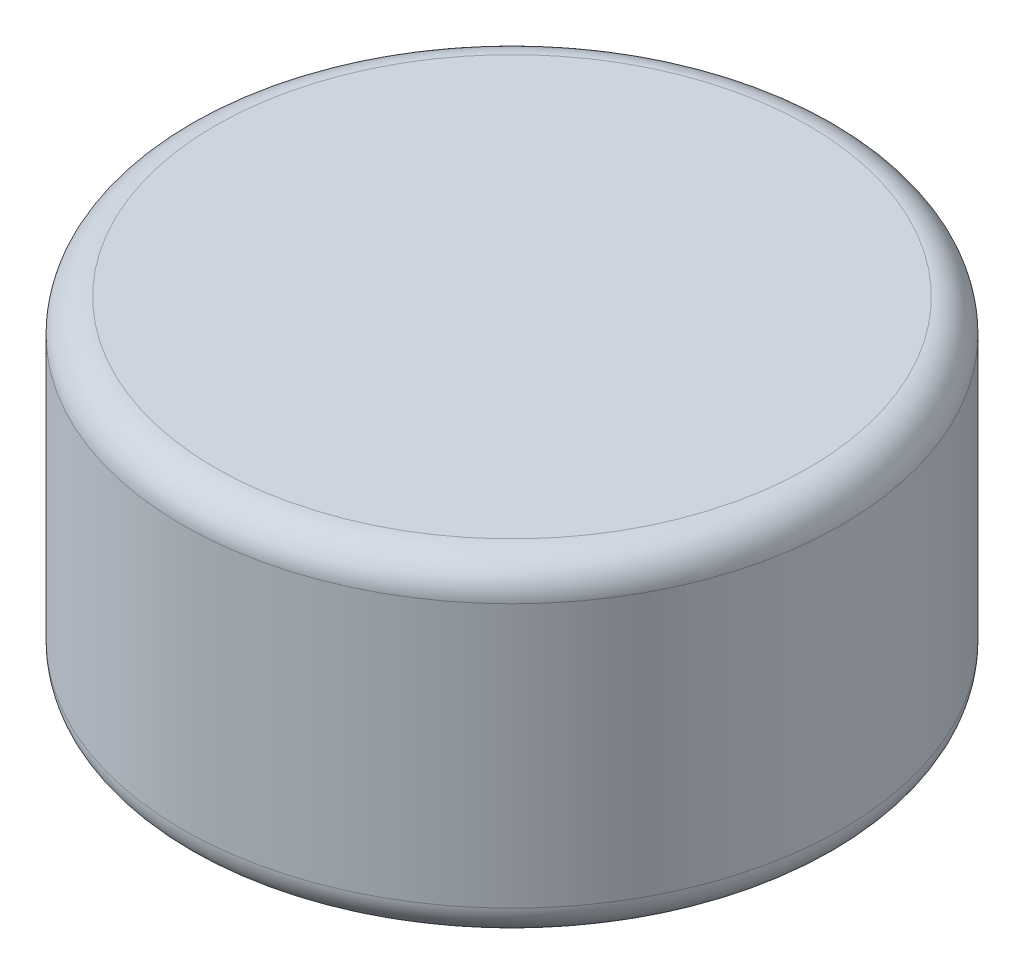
ISO-10303-21;
HEADER;
FILE_DESCRIPTION(('STEP AP214'),'2;1');
FILE_NAME('part.step','',(''),(''),'','','');
FILE_SCHEMA(('AUTOMOTIVE_DESIGN { 1 0 10303 214 1 1 1 1 }'));
ENDSEC;
DATA;
#1=APPLICATION_CONTEXT('core data for automotive mechanical design processes');
#2=APPLICATION_PROTOCOL_DEFINITION('international standard','automotive_design',2000,#1);
#3=PRODUCT_CONTEXT('',#1,'mechanical');
#4=PRODUCT('Part','Part','',(#3));
#5=PRODUCT_RELATED_PRODUCT_CATEGORY('part','',(#4));
#6=PRODUCT_DEFINITION_FORMATION('','',#4);
#7=PRODUCT_DEFINITION_CONTEXT('part definition',#1,'design');
#8=PRODUCT_DEFINITION('design','',#6,#7);
#9=PRODUCT_DEFINITION_SHAPE('','',#8);
#10=(LENGTH_UNIT() NAMED_UNIT(*) SI_UNIT(.MILLI.,.METRE.));
#11=(NAMED_UNIT(*) PLANE_ANGLE_UNIT() SI_UNIT($,.RADIAN.));
#12=(NAMED_UNIT(*) SI_UNIT($,.STERADIAN.) SOLID_ANGLE_UNIT());
#13=UNCERTAINTY_MEASURE_WITH_UNIT(LENGTH_MEASURE(1.E-05),#10,'distance_accuracy_value','');
#14=(GEOMETRIC_REPRESENTATION_CONTEXT(3) GLOBAL_UNCERTAINTY_ASSIGNED_CONTEXT((#13)) GLOBAL_UNIT_ASSIGNED_CONTEXT((#10,
#11,#12)) REPRESENTATION_CONTEXT('',''));
#15=CARTESIAN_POINT('',(0.,0.,0.));
#16=DIRECTION('',(0.,0.,1.));
#17=DIRECTION('',(1.,0.,0.));
#18=AXIS2_PLACEMENT_3D('',#15,#16,#17);
#19=CARTESIAN_POINT('',(0.,0.79375,0.));
#20=DIRECTION('',(0.,-1.,0.));
#21=DIRECTION('',(0.,0.,-1.));
#22=AXIS2_PLACEMENT_3D('',#19,#20,#21);
#23=CYLINDRICAL_SURFACE('',#22,1.5875);
#24=CARTESIAN_POINT('',(0.,-0.635,0.));
#25=DIRECTION('',(0.,1.,0.));
#26=DIRECTION('',(0.,0.,1.));
#27=AXIS2_PLACEMENT_3D('',#24,#25,#26);
#28=CIRCLE('',#27,1.5875);
#29=CARTESIAN_POINT('',(0.,-0.635,1.5875));
#30=VERTEX_POINT('',#29);
#31=EDGE_CURVE('E44',#30,#30,#28,.T.);
#32=ORIENTED_EDGE('',*,*,#31,.T.);
#33=EDGE_LOOP('',(#32));
#34=FACE_BOUND('',#33,.T.);
#35=CARTESIAN_POINT('',(0.,0.635,0.));
#36=DIRECTION('',(0.,1.,0.));
#37=DIRECTION('',(0.,0.,1.));
#38=AXIS2_PLACEMENT_3D('',#35,#36,#37);
#39=CIRCLE('',#38,1.5875);
#40=CARTESIAN_POINT('',(0.,0.635,1.5875));
#41=VERTEX_POINT('',#40);
#42=EDGE_CURVE('E49',#41,#41,#39,.F.);
#43=ORIENTED_EDGE('',*,*,#42,.T.);
#44=EDGE_LOOP('',(#43));
#45=FACE_BOUND('',#44,.T.);
#46=ADVANCED_FACE('F32',(#34,#45),#23,.T.);
#47=CARTESIAN_POINT('',(0.,0.79375,0.));
#48=DIRECTION('',(0.,1.,0.));
#49=DIRECTION('',(0.,0.,1.));
#50=AXIS2_PLACEMENT_3D('',#47,#48,#49);
#51=PLANE('',#50);
#52=CARTESIAN_POINT('',(0.,0.79375,0.));
#53=DIRECTION('',(0.,1.,0.));
#54=DIRECTION('',(0.,0.,1.));
#55=AXIS2_PLACEMENT_3D('',#52,#53,#54);
#56=CIRCLE('',#55,1.42875);
#57=CARTESIAN_POINT('',(0.,0.79375,1.42875));
#58=VERTEX_POINT('',#57);
#59=EDGE_CURVE('E10',#58,#58,#56,.T.);
#60=ORIENTED_EDGE('',*,*,#59,.T.);
#61=EDGE_LOOP('',(#60));
#62=FACE_BOUND('',#61,.T.);
#63=ADVANCED_FACE('F65',(#62),#51,.T.);
#64=CARTESIAN_POINT('',(0.,-0.79375,0.));
#65=DIRECTION('',(0.,1.,0.));
#66=DIRECTION('',(0.,0.,1.));
#67=AXIS2_PLACEMENT_3D('',#64,#65,#66);
#68=PLANE('',#67);
#69=CARTESIAN_POINT('',(0.,-0.79375,0.));
#70=DIRECTION('',(0.,1.,0.));
#71=DIRECTION('',(0.,0.,1.));
#72=AXIS2_PLACEMENT_3D('',#69,#70,#71);
#73=CIRCLE('',#72,1.42875);
#74=CARTESIAN_POINT('',(0.,-0.79375,1.42875));
#75=VERTEX_POINT('',#74);
#76=EDGE_CURVE('E39',#75,#75,#73,.F.);
#77=ORIENTED_EDGE('',*,*,#76,.T.);
#78=EDGE_LOOP('',(#77));
#79=FACE_BOUND('',#78,.T.);
#80=ADVANCED_FACE('F62',(#79),#68,.F.);
#81=CARTESIAN_POINT('',(0.,-0.635,0.));
#82=DIRECTION('',(0.,1.,0.));
#83=DIRECTION('',(0.,0.,1.));
#84=AXIS2_PLACEMENT_3D('',#81,#82,#83);
#85=TOROIDAL_SURFACE('',#84,1.42875,0.15875);
#86=ORIENTED_EDGE('',*,*,#76,.F.);
#87=EDGE_LOOP('',(#86));
#88=FACE_BOUND('',#87,.T.);
#89=ORIENTED_EDGE('',*,*,#31,.F.);
#90=EDGE_LOOP('',(#89));
#91=FACE_BOUND('',#90,.T.);
#92=ADVANCED_FACE('F58',(#88,#91),#85,.T.);
#93=CARTESIAN_POINT('',(0.,0.635,0.));
#94=DIRECTION('',(0.,1.,0.));
#95=DIRECTION('',(0.,0.,1.));
#96=AXIS2_PLACEMENT_3D('',#93,#94,#95);
#97=TOROIDAL_SURFACE('',#96,1.42875,0.15875);
#98=ORIENTED_EDGE('',*,*,#42,.F.);
#99=EDGE_LOOP('',(#98));
#100=FACE_BOUND('',#99,.T.);
#101=ORIENTED_EDGE('',*,*,#59,.F.);
#102=EDGE_LOOP('',(#101));
#103=FACE_BOUND('',#102,.T.);
#104=ADVANCED_FACE('F34',(#100,#103),#97,.T.);
#105=CLOSED_SHELL('',(#46,#63,#80,#92,#104));
#106=MANIFOLD_SOLID_BREP('B2',#105);
#107=ADVANCED_BREP_SHAPE_REPRESENTATION('',(#18,#106),#14);
#108=SHAPE_DEFINITION_REPRESENTATION(#9,#107);
ENDSEC;
END-ISO-10303-21;
